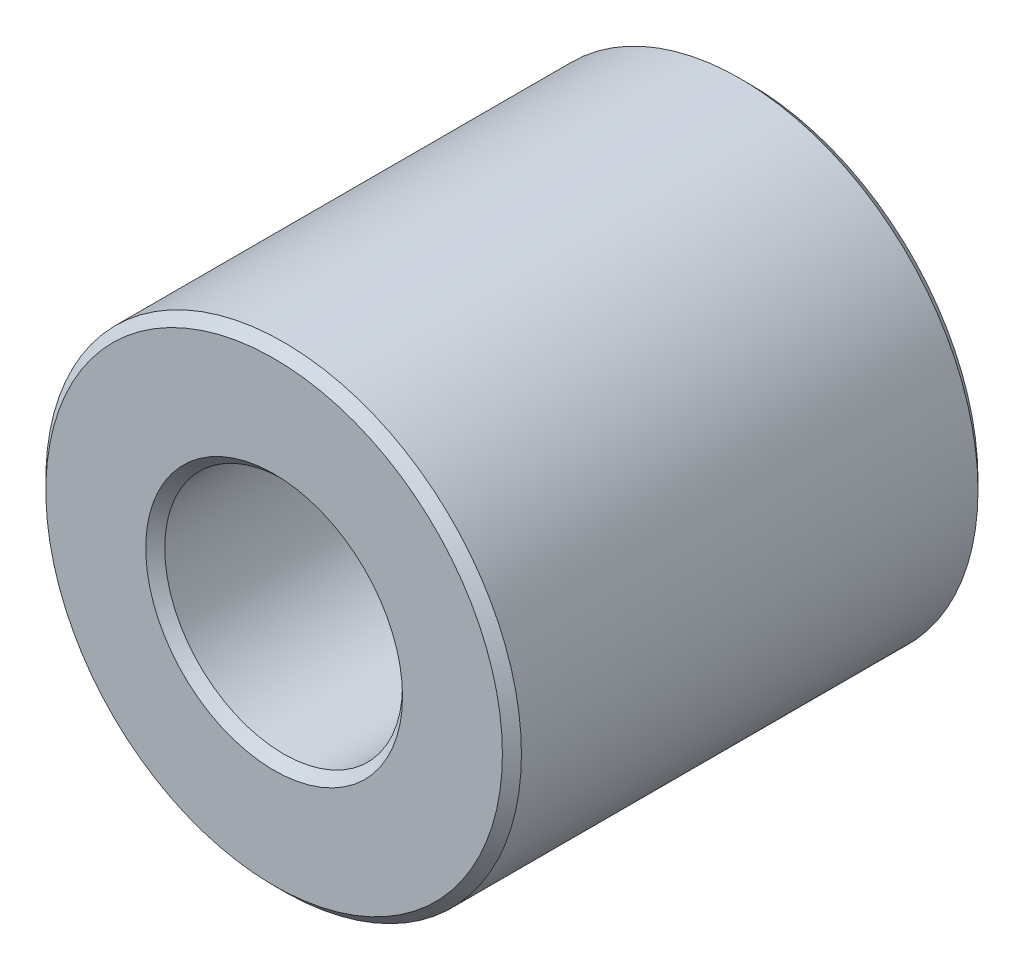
ISO-10303-21;
HEADER;
FILE_DESCRIPTION(('STEP AP214'),'2;1');
FILE_NAME('part.step','',(''),(''),'','','');
FILE_SCHEMA(('AUTOMOTIVE_DESIGN { 1 0 10303 214 1 1 1 1 }'));
ENDSEC;
DATA;
#1=APPLICATION_CONTEXT('core data for automotive mechanical design processes');
#2=APPLICATION_PROTOCOL_DEFINITION('international standard','automotive_design',2000,#1);
#3=PRODUCT_CONTEXT('',#1,'mechanical');
#4=PRODUCT('Part','Part','',(#3));
#5=PRODUCT_RELATED_PRODUCT_CATEGORY('part','',(#4));
#6=PRODUCT_DEFINITION_FORMATION('','',#4);
#7=PRODUCT_DEFINITION_CONTEXT('part definition',#1,'design');
#8=PRODUCT_DEFINITION('design','',#6,#7);
#9=PRODUCT_DEFINITION_SHAPE('','',#8);
#10=(LENGTH_UNIT() NAMED_UNIT(*) SI_UNIT(.MILLI.,.METRE.));
#11=(NAMED_UNIT(*) PLANE_ANGLE_UNIT() SI_UNIT($,.RADIAN.));
#12=(NAMED_UNIT(*) SI_UNIT($,.STERADIAN.) SOLID_ANGLE_UNIT());
#13=UNCERTAINTY_MEASURE_WITH_UNIT(LENGTH_MEASURE(1.E-05),#10,'distance_accuracy_value','');
#14=(GEOMETRIC_REPRESENTATION_CONTEXT(3) GLOBAL_UNCERTAINTY_ASSIGNED_CONTEXT((#13)) GLOBAL_UNIT_ASSIGNED_CONTEXT((#10,
#11,#12)) REPRESENTATION_CONTEXT('',''));
#15=CARTESIAN_POINT('',(0.,0.,0.));
#16=DIRECTION('',(0.,0.,1.));
#17=DIRECTION('',(1.,0.,0.));
#18=AXIS2_PLACEMENT_3D('',#15,#16,#17);
#19=CARTESIAN_POINT('',(0.,0.,2.5));
#20=DIRECTION('',(0.,0.,1.));
#21=DIRECTION('',(1.,0.,0.));
#22=AXIS2_PLACEMENT_3D('',#19,#20,#21);
#23=PLANE('',#22);
#24=CARTESIAN_POINT('',(0.,0.,2.5));
#25=DIRECTION('',(0.,0.,1.));
#26=DIRECTION('',(1.,0.,0.));
#27=AXIS2_PLACEMENT_3D('',#24,#25,#26);
#28=CIRCLE('',#27,1.35);
#29=CARTESIAN_POINT('',(1.35,0.,2.5));
#30=VERTEX_POINT('',#29);
#31=EDGE_CURVE('E10',#30,#30,#28,.F.);
#32=ORIENTED_EDGE('',*,*,#31,.T.);
#33=EDGE_LOOP('',(#32));
#34=FACE_BOUND('',#33,.T.);
#35=CARTESIAN_POINT('',(0.,0.,2.5));
#36=DIRECTION('',(0.,0.,1.));
#37=DIRECTION('',(1.,0.,0.));
#38=AXIS2_PLACEMENT_3D('',#35,#36,#37);
#39=CIRCLE('',#38,2.4);
#40=CARTESIAN_POINT('',(2.4,0.,2.5));
#41=VERTEX_POINT('',#40);
#42=EDGE_CURVE('E45',#41,#41,#39,.T.);
#43=ORIENTED_EDGE('',*,*,#42,.T.);
#44=EDGE_LOOP('',(#43));
#45=FACE_BOUND('',#44,.T.);
#46=ADVANCED_FACE('F37',(#34,#45),#23,.T.);
#47=CARTESIAN_POINT('',(0.,0.,-2.5));
#48=DIRECTION('',(0.,0.,1.));
#49=DIRECTION('',(1.,0.,0.));
#50=AXIS2_PLACEMENT_3D('',#47,#48,#49);
#51=PLANE('',#50);
#52=CARTESIAN_POINT('',(0.,0.,-2.5));
#53=DIRECTION('',(0.,0.,1.));
#54=DIRECTION('',(1.,0.,0.));
#55=AXIS2_PLACEMENT_3D('',#52,#53,#54);
#56=CIRCLE('',#55,2.4);
#57=CARTESIAN_POINT('',(2.4,0.,-2.5));
#58=VERTEX_POINT('',#57);
#59=EDGE_CURVE('E63',#58,#58,#56,.F.);
#60=ORIENTED_EDGE('',*,*,#59,.T.);
#61=EDGE_LOOP('',(#60));
#62=FACE_BOUND('',#61,.T.);
#63=CARTESIAN_POINT('',(0.,0.,-2.5));
#64=DIRECTION('',(0.,0.,1.));
#65=DIRECTION('',(1.,0.,0.));
#66=AXIS2_PLACEMENT_3D('',#63,#64,#65);
#67=CIRCLE('',#66,1.35);
#68=CARTESIAN_POINT('',(1.35,0.,-2.5));
#69=VERTEX_POINT('',#68);
#70=EDGE_CURVE('E66',#69,#69,#67,.T.);
#71=ORIENTED_EDGE('',*,*,#70,.T.);
#72=EDGE_LOOP('',(#71));
#73=FACE_BOUND('',#72,.T.);
#74=ADVANCED_FACE('F89',(#62,#73),#51,.F.);
#75=CARTESIAN_POINT('',(0.,0.,2.5));
#76=DIRECTION('',(0.,0.,-1.));
#77=DIRECTION('',(-1.,0.,0.));
#78=AXIS2_PLACEMENT_3D('',#75,#76,#77);
#79=CYLINDRICAL_SURFACE('',#78,2.5);
#80=CARTESIAN_POINT('',(0.,0.,-2.4));
#81=DIRECTION('',(0.,0.,1.));
#82=DIRECTION('',(1.,0.,0.));
#83=AXIS2_PLACEMENT_3D('',#80,#81,#82);
#84=CIRCLE('',#83,2.5);
#85=CARTESIAN_POINT('',(2.5,0.,-2.4));
#86=VERTEX_POINT('',#85);
#87=EDGE_CURVE('E69',#86,#86,#84,.T.);
#88=ORIENTED_EDGE('',*,*,#87,.T.);
#89=EDGE_LOOP('',(#88));
#90=FACE_BOUND('',#89,.T.);
#91=CARTESIAN_POINT('',(0.,0.,2.4));
#92=DIRECTION('',(0.,0.,1.));
#93=DIRECTION('',(1.,0.,0.));
#94=AXIS2_PLACEMENT_3D('',#91,#92,#93);
#95=CIRCLE('',#94,2.5);
#96=CARTESIAN_POINT('',(2.5,0.,2.4));
#97=VERTEX_POINT('',#96);
#98=EDGE_CURVE('E73',#97,#97,#95,.F.);
#99=ORIENTED_EDGE('',*,*,#98,.T.);
#100=EDGE_LOOP('',(#99));
#101=FACE_BOUND('',#100,.T.);
#102=ADVANCED_FACE('F78',(#90,#101),#79,.T.);
#103=CARTESIAN_POINT('',(0.,0.,2.5));
#104=DIRECTION('',(0.,0.,-1.));
#105=DIRECTION('',(-1.,0.,0.));
#106=AXIS2_PLACEMENT_3D('',#103,#104,#105);
#107=CYLINDRICAL_SURFACE('',#106,1.25);
#108=CARTESIAN_POINT('',(0.,0.,-2.4));
#109=DIRECTION('',(0.,0.,1.));
#110=DIRECTION('',(1.,0.,0.));
#111=AXIS2_PLACEMENT_3D('',#108,#109,#110);
#112=CIRCLE('',#111,1.25);
#113=CARTESIAN_POINT('',(1.25,0.,-2.4));
#114=VERTEX_POINT('',#113);
#115=EDGE_CURVE('E51',#114,#114,#112,.F.);
#116=ORIENTED_EDGE('',*,*,#115,.T.);
#117=EDGE_LOOP('',(#116));
#118=FACE_BOUND('',#117,.T.);
#119=CARTESIAN_POINT('',(0.,0.,2.4));
#120=DIRECTION('',(0.,0.,1.));
#121=DIRECTION('',(1.,0.,0.));
#122=AXIS2_PLACEMENT_3D('',#119,#120,#121);
#123=CIRCLE('',#122,1.25);
#124=CARTESIAN_POINT('',(1.25,0.,2.4));
#125=VERTEX_POINT('',#124);
#126=EDGE_CURVE('E57',#125,#125,#123,.T.);
#127=ORIENTED_EDGE('',*,*,#126,.T.);
#128=EDGE_LOOP('',(#127));
#129=FACE_BOUND('',#128,.T.);
#130=ADVANCED_FACE('F97',(#118,#129),#107,.F.);
#131=CARTESIAN_POINT('',(0.,0.,-2.4));
#132=DIRECTION('',(0.,0.,1.));
#133=DIRECTION('',(1.,0.,0.));
#134=AXIS2_PLACEMENT_3D('',#131,#132,#133);
#135=CONICAL_SURFACE('',#134,2.5,0.785398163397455);
#136=ORIENTED_EDGE('',*,*,#59,.F.);
#137=EDGE_LOOP('',(#136));
#138=FACE_BOUND('',#137,.T.);
#139=ORIENTED_EDGE('',*,*,#87,.F.);
#140=EDGE_LOOP('',(#139));
#141=FACE_BOUND('',#140,.T.);
#142=ADVANCED_FACE('F102',(#138,#141),#135,.T.);
#143=CARTESIAN_POINT('',(0.,0.,-2.5));
#144=DIRECTION('',(0.,0.,-1.));
#145=DIRECTION('',(-1.,0.,0.));
#146=AXIS2_PLACEMENT_3D('',#143,#144,#145);
#147=CONICAL_SURFACE('',#146,1.35,0.785398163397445);
#148=ORIENTED_EDGE('',*,*,#115,.F.);
#149=EDGE_LOOP('',(#148));
#150=FACE_BOUND('',#149,.T.);
#151=ORIENTED_EDGE('',*,*,#70,.F.);
#152=EDGE_LOOP('',(#151));
#153=FACE_BOUND('',#152,.T.);
#154=ADVANCED_FACE('F86',(#150,#153),#147,.F.);
#155=CARTESIAN_POINT('',(0.,0.,2.4));
#156=DIRECTION('',(0.,0.,1.));
#157=DIRECTION('',(1.,0.,0.));
#158=AXIS2_PLACEMENT_3D('',#155,#156,#157);
#159=CONICAL_SURFACE('',#158,1.25,0.785398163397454);
#160=ORIENTED_EDGE('',*,*,#31,.F.);
#161=EDGE_LOOP('',(#160));
#162=FACE_BOUND('',#161,.T.);
#163=ORIENTED_EDGE('',*,*,#126,.F.);
#164=EDGE_LOOP('',(#163));
#165=FACE_BOUND('',#164,.T.);
#166=ADVANCED_FACE('F82',(#162,#165),#159,.F.);
#167=CARTESIAN_POINT('',(0.,0.,2.5));
#168=DIRECTION('',(0.,0.,-1.));
#169=DIRECTION('',(-1.,0.,0.));
#170=AXIS2_PLACEMENT_3D('',#167,#168,#169);
#171=CONICAL_SURFACE('',#170,2.4,0.785398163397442);
#172=ORIENTED_EDGE('',*,*,#98,.F.);
#173=EDGE_LOOP('',(#172));
#174=FACE_BOUND('',#173,.T.);
#175=ORIENTED_EDGE('',*,*,#42,.F.);
#176=EDGE_LOOP('',(#175));
#177=FACE_BOUND('',#176,.T.);
#178=ADVANCED_FACE('F39',(#174,#177),#171,.T.);
#179=CLOSED_SHELL('',(#46,#74,#102,#130,#142,#154,#166,#178));
#180=MANIFOLD_SOLID_BREP('B2',#179);
#181=ADVANCED_BREP_SHAPE_REPRESENTATION('',(#18,#180),#14);
#182=SHAPE_DEFINITION_REPRESENTATION(#9,#181);
ENDSEC;
END-ISO-10303-21;
